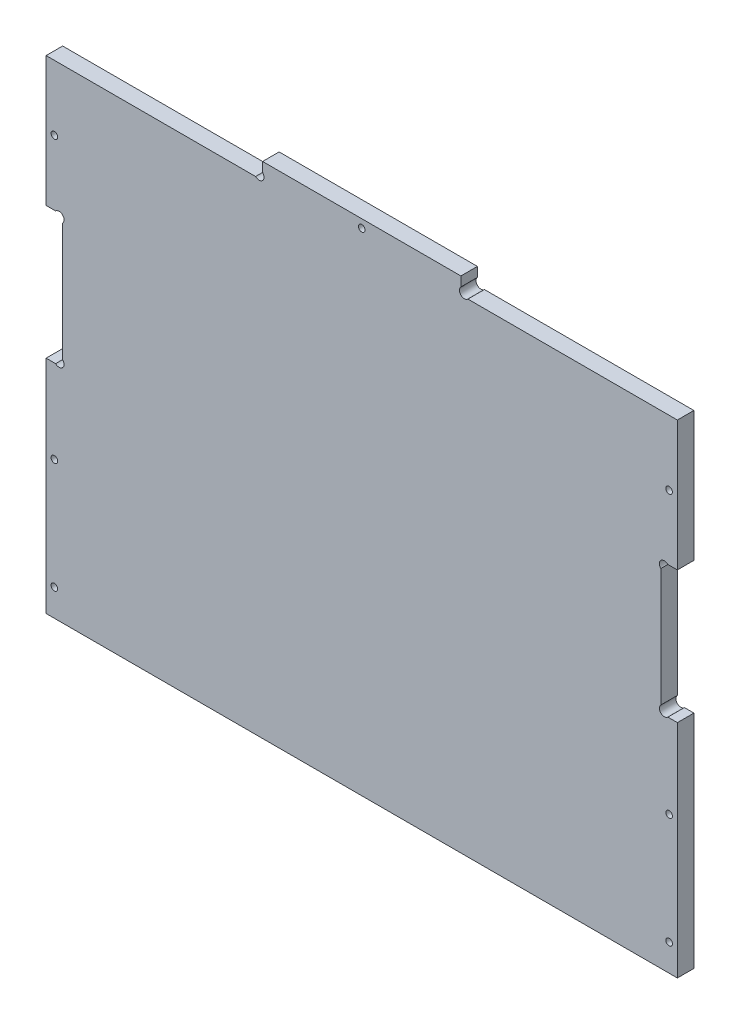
from build123d import *

# Parameters (mm, degrees)
ESQUISSE1_R        = 1
BOSS_EXTRU_1_DEPTH = 5


with BuildPart() as part:
    # Esquisse1 → Boss.-Extru.1 (new body)
    with BuildSketch(Plane.XY):
        with BuildLine():
            Line((-30, 40.648672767), (30, 40.648672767))
            Line((30, 40.648672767), (30, 37.76999311))
            ThreePointArc((30, 37.76999311), (30, 35.648672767), (32.121320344, 35.648672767))
            Line((32.121320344, 35.648672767), (95.5, 35.648672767))
            Line((95.5, 35.648672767), (95.5, -3.641327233))
            Line((95.5, -3.641327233), (92.621320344, -3.641327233))
            ThreePointArc((92.621320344, -3.641327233), (90.5, -3.641327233), (90.5, -5.762647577))
            Line((90.5, -5.762647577), (90.5, -41.52000689))
            ThreePointArc((90.5, -41.52000689), (90.5, -43.641327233), (92.621320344, -43.641327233))
            Line((92.621320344, -43.641327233), (95.5, -43.641327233))
            Line((95.5, -43.641327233), (95.5, -110.561327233))
            Line((95.5, -110.561327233), (-95.5, -110.561327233))
            Line((-95.5, -110.561327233), (-95.5, -43.641327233))
            Line((-95.5, -43.641327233), (-92.621320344, -43.641327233))
            ThreePointArc((-92.621320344, -43.641327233), (-90.5, -43.641327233), (-90.5, -41.52000689))
            Line((-90.5, -41.52000689), (-90.5, -5.762647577))
            ThreePointArc((-90.5, -5.762647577), (-90.5, -3.641327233), (-92.621320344, -3.641327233))
            Line((-92.621320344, -3.641327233), (-95.5, -3.641327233))
            Line((-95.5, -3.641327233), (-95.5, 35.648672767))
            Line((-95.5, 35.648672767), (-32.121320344, 35.648672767))
            ThreePointArc((-32.121320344, 35.648672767), (-30, 35.648672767), (-30, 37.76999311))
            Line((-30, 37.76999311), (-30, 40.648672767))
        make_face()
        with Locations((-93, -68.921327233)):
            Circle(ESQUISSE1_R, mode=Mode.SUBTRACT)
        with Locations((-93, -102.381327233)):
            Circle(ESQUISSE1_R, mode=Mode.SUBTRACT)
        with Locations((93, 16.003672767)):
            Circle(ESQUISSE1_R, mode=Mode.SUBTRACT)
        with Locations((-93, 16.003672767)):
            Circle(ESQUISSE1_R, mode=Mode.SUBTRACT)
        with Locations((93, -102.381327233)):
            Circle(ESQUISSE1_R, mode=Mode.SUBTRACT)
        with Locations((93, -68.921327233)):
            Circle(ESQUISSE1_R, mode=Mode.SUBTRACT)
        with Locations((0, 38.148672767)):
            Circle(ESQUISSE1_R, mode=Mode.SUBTRACT)
    extrude(amount=BOSS_EXTRU_1_DEPTH)


solid = part.part
